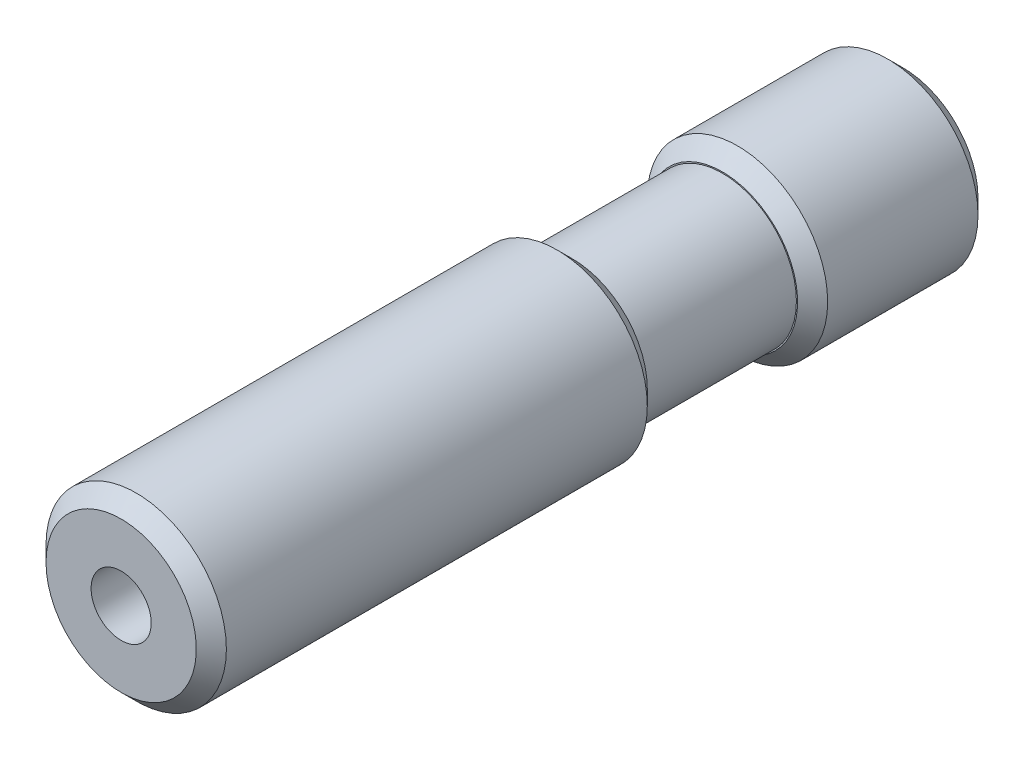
ISO-10303-21;
HEADER;
FILE_DESCRIPTION(('STEP AP214'),'2;1');
FILE_NAME('part.step','',(''),(''),'','','');
FILE_SCHEMA(('AUTOMOTIVE_DESIGN { 1 0 10303 214 1 1 1 1 }'));
ENDSEC;
DATA;
#1=APPLICATION_CONTEXT('core data for automotive mechanical design processes');
#2=APPLICATION_PROTOCOL_DEFINITION('international standard','automotive_design',2000,#1);
#3=PRODUCT_CONTEXT('',#1,'mechanical');
#4=PRODUCT('Part','Part','',(#3));
#5=PRODUCT_RELATED_PRODUCT_CATEGORY('part','',(#4));
#6=PRODUCT_DEFINITION_FORMATION('','',#4);
#7=PRODUCT_DEFINITION_CONTEXT('part definition',#1,'design');
#8=PRODUCT_DEFINITION('design','',#6,#7);
#9=PRODUCT_DEFINITION_SHAPE('','',#8);
#10=(LENGTH_UNIT() NAMED_UNIT(*) SI_UNIT(.MILLI.,.METRE.));
#11=(NAMED_UNIT(*) PLANE_ANGLE_UNIT() SI_UNIT($,.RADIAN.));
#12=(NAMED_UNIT(*) SI_UNIT($,.STERADIAN.) SOLID_ANGLE_UNIT());
#13=UNCERTAINTY_MEASURE_WITH_UNIT(LENGTH_MEASURE(1.E-05),#10,'distance_accuracy_value','');
#14=(GEOMETRIC_REPRESENTATION_CONTEXT(3) GLOBAL_UNCERTAINTY_ASSIGNED_CONTEXT((#13)) GLOBAL_UNIT_ASSIGNED_CONTEXT((#10,
#11,#12)) REPRESENTATION_CONTEXT('',''));
#15=CARTESIAN_POINT('',(0.,0.,0.));
#16=DIRECTION('',(0.,0.,1.));
#17=DIRECTION('',(1.,0.,0.));
#18=AXIS2_PLACEMENT_3D('',#15,#16,#17);
#19=CARTESIAN_POINT('',(0.,0.,0.));
#20=DIRECTION('',(0.,0.,1.));
#21=DIRECTION('',(1.,0.,0.));
#22=AXIS2_PLACEMENT_3D('',#19,#20,#21);
#23=CYLINDRICAL_SURFACE('',#22,3.00000000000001);
#24=CARTESIAN_POINT('',(0.,0.,-20.5000000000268));
#25=DIRECTION('',(0.,0.,-1.));
#26=DIRECTION('',(-1.,0.,0.));
#27=AXIS2_PLACEMENT_3D('',#24,#25,#26);
#28=CIRCLE('',#27,2.9999999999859);
#29=CARTESIAN_POINT('',(-2.9999999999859,0.,-20.5000000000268));
#30=VERTEX_POINT('',#29);
#31=EDGE_CURVE('E33',#30,#30,#28,.F.);
#32=ORIENTED_EDGE('',*,*,#31,.F.);
#33=EDGE_LOOP('',(#32));
#34=FACE_BOUND('',#33,.T.);
#35=CARTESIAN_POINT('',(0.,0.,-25.5000000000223));
#36=DIRECTION('',(0.,0.,1.));
#37=DIRECTION('',(1.,0.,0.));
#38=AXIS2_PLACEMENT_3D('',#35,#36,#37);
#39=CIRCLE('',#38,2.9999999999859);
#40=CARTESIAN_POINT('',(2.9999999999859,0.,-25.5000000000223));
#41=VERTEX_POINT('',#40);
#42=EDGE_CURVE('E30',#41,#41,#39,.F.);
#43=ORIENTED_EDGE('',*,*,#42,.F.);
#44=EDGE_LOOP('',(#43));
#45=FACE_BOUND('',#44,.T.);
#46=ADVANCED_FACE('F15',(#34,#45),#23,.T.);
#47=CARTESIAN_POINT('',(0.,0.,-20.49999999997));
#48=DIRECTION('',(0.,0.,-1.));
#49=DIRECTION('',(-1.,0.,0.));
#50=AXIS2_PLACEMENT_3D('',#47,#48,#49);
#51=CONICAL_SURFACE('',#50,2.99999999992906,0.785398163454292);
#52=CARTESIAN_POINT('',(0.,0.,-20.0000000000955));
#53=DIRECTION('',(0.,0.,-1.));
#54=DIRECTION('',(-1.,0.,0.));
#55=AXIS2_PLACEMENT_3D('',#52,#53,#54);
#56=CIRCLE('',#55,2.49999999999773);
#57=CARTESIAN_POINT('',(-2.49999999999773,0.,-20.0000000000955));
#58=VERTEX_POINT('',#57);
#59=EDGE_CURVE('E18',#58,#58,#56,.T.);
#60=ORIENTED_EDGE('',*,*,#59,.T.);
#61=EDGE_LOOP('',(#60));
#62=FACE_BOUND('',#61,.T.);
#63=ORIENTED_EDGE('',*,*,#31,.T.);
#64=EDGE_LOOP('',(#63));
#65=FACE_BOUND('',#64,.T.);
#66=ADVANCED_FACE('F59',(#62,#65),#51,.T.);
#67=CARTESIAN_POINT('',(0.,0.,-25.5000000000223));
#68=DIRECTION('',(0.,0.,1.));
#69=DIRECTION('',(1.,0.,0.));
#70=AXIS2_PLACEMENT_3D('',#67,#68,#69);
#71=CONICAL_SURFACE('',#70,2.9999999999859,0.785398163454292);
#72=ORIENTED_EDGE('',*,*,#42,.T.);
#73=EDGE_LOOP('',(#72));
#74=FACE_BOUND('',#73,.T.);
#75=CARTESIAN_POINT('',(0.,0.,-26.0000000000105));
#76=DIRECTION('',(0.,0.,1.));
#77=DIRECTION('',(1.,0.,0.));
#78=AXIS2_PLACEMENT_3D('',#75,#76,#77);
#79=CIRCLE('',#78,2.49999999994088);
#80=CARTESIAN_POINT('',(2.49999999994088,0.,-26.0000000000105));
#81=VERTEX_POINT('',#80);
#82=EDGE_CURVE('E52',#81,#81,#79,.T.);
#83=ORIENTED_EDGE('',*,*,#82,.T.);
#84=EDGE_LOOP('',(#83));
#85=FACE_BOUND('',#84,.T.);
#86=ADVANCED_FACE('F66',(#74,#85),#71,.T.);
#87=CARTESIAN_POINT('',(0.,2.50000000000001,-20.));
#88=DIRECTION('',(0.,0.,-1.));
#89=DIRECTION('',(-1.,0.,0.));
#90=AXIS2_PLACEMENT_3D('',#87,#88,#89);
#91=PLANE('',#90);
#92=ORIENTED_EDGE('',*,*,#59,.F.);
#93=EDGE_LOOP('',(#92));
#94=FACE_BOUND('',#93,.T.);
#95=CARTESIAN_POINT('',(0.,0.,-20.));
#96=DIRECTION('',(0.,0.,1.));
#97=DIRECTION('',(1.,0.,0.));
#98=AXIS2_PLACEMENT_3D('',#95,#96,#97);
#99=CIRCLE('',#98,2.45989001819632);
#100=CARTESIAN_POINT('',(2.45989001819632,0.,-20.));
#101=VERTEX_POINT('',#100);
#102=EDGE_CURVE('E50',#101,#101,#99,.T.);
#103=ORIENTED_EDGE('',*,*,#102,.F.);
#104=EDGE_LOOP('',(#103));
#105=FACE_BOUND('',#104,.T.);
#106=ADVANCED_FACE('F62',(#94,#105),#91,.F.);
#107=CARTESIAN_POINT('',(0.,1.,-26.));
#108=DIRECTION('',(0.,0.,1.));
#109=DIRECTION('',(1.,0.,0.));
#110=AXIS2_PLACEMENT_3D('',#107,#108,#109);
#111=PLANE('',#110);
#112=CARTESIAN_POINT('',(0.,0.,-26.));
#113=DIRECTION('',(0.,0.,1.));
#114=DIRECTION('',(1.,0.,0.));
#115=AXIS2_PLACEMENT_3D('',#112,#113,#114);
#116=CIRCLE('',#115,1.);
#117=CARTESIAN_POINT('',(1.,0.,-26.));
#118=VERTEX_POINT('',#117);
#119=EDGE_CURVE('E47',#118,#118,#116,.T.);
#120=ORIENTED_EDGE('',*,*,#119,.T.);
#121=EDGE_LOOP('',(#120));
#122=FACE_BOUND('',#121,.T.);
#123=ORIENTED_EDGE('',*,*,#82,.F.);
#124=EDGE_LOOP('',(#123));
#125=FACE_BOUND('',#124,.T.);
#126=ADVANCED_FACE('F65',(#122,#125),#111,.F.);
#127=CARTESIAN_POINT('',(0.,0.,0.));
#128=DIRECTION('',(0.,0.,1.));
#129=DIRECTION('',(1.,0.,0.));
#130=AXIS2_PLACEMENT_3D('',#127,#128,#129);
#131=CYLINDRICAL_SURFACE('',#130,2.45989001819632);
#132=CARTESIAN_POINT('',(0.,0.,-15.));
#133=DIRECTION('',(0.,0.,1.));
#134=DIRECTION('',(1.,0.,0.));
#135=AXIS2_PLACEMENT_3D('',#132,#133,#134);
#136=CIRCLE('',#135,2.45989001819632);
#137=CARTESIAN_POINT('',(2.45989001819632,0.,-15.));
#138=VERTEX_POINT('',#137);
#139=EDGE_CURVE('E44',#138,#138,#136,.F.);
#140=ORIENTED_EDGE('',*,*,#139,.T.);
#141=EDGE_LOOP('',(#140));
#142=FACE_BOUND('',#141,.T.);
#143=ORIENTED_EDGE('',*,*,#102,.T.);
#144=EDGE_LOOP('',(#143));
#145=FACE_BOUND('',#144,.T.);
#146=ADVANCED_FACE('F70',(#142,#145),#131,.T.);
#147=CARTESIAN_POINT('',(0.,0.,0.));
#148=DIRECTION('',(0.,0.,1.));
#149=DIRECTION('',(1.,0.,0.));
#150=AXIS2_PLACEMENT_3D('',#147,#148,#149);
#151=CYLINDRICAL_SURFACE('',#150,1.);
#152=ORIENTED_EDGE('',*,*,#119,.F.);
#153=EDGE_LOOP('',(#152));
#154=FACE_BOUND('',#153,.T.);
#155=CARTESIAN_POINT('',(0.,0.,0.));
#156=DIRECTION('',(0.,0.,1.));
#157=DIRECTION('',(1.,0.,0.));
#158=AXIS2_PLACEMENT_3D('',#155,#156,#157);
#159=CIRCLE('',#158,1.);
#160=CARTESIAN_POINT('',(1.,0.,0.));
#161=VERTEX_POINT('',#160);
#162=EDGE_CURVE('E41',#161,#161,#159,.T.);
#163=ORIENTED_EDGE('',*,*,#162,.T.);
#164=EDGE_LOOP('',(#163));
#165=FACE_BOUND('',#164,.T.);
#166=ADVANCED_FACE('F72',(#154,#165),#151,.F.);
#167=CARTESIAN_POINT('',(0.,2.45989001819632,-15.));
#168=DIRECTION('',(0.,0.,1.));
#169=DIRECTION('',(1.,0.,0.));
#170=AXIS2_PLACEMENT_3D('',#167,#168,#169);
#171=PLANE('',#170);
#172=ORIENTED_EDGE('',*,*,#139,.F.);
#173=EDGE_LOOP('',(#172));
#174=FACE_BOUND('',#173,.T.);
#175=CARTESIAN_POINT('',(0.,0.,-15.0000000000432));
#176=DIRECTION('',(0.,0.,1.));
#177=DIRECTION('',(1.,0.,0.));
#178=AXIS2_PLACEMENT_3D('',#175,#176,#177);
#179=CIRCLE('',#178,2.49999999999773);
#180=CARTESIAN_POINT('',(2.49999999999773,0.,-15.0000000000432));
#181=VERTEX_POINT('',#180);
#182=EDGE_CURVE('E38',#181,#181,#179,.T.);
#183=ORIENTED_EDGE('',*,*,#182,.F.);
#184=EDGE_LOOP('',(#183));
#185=FACE_BOUND('',#184,.T.);
#186=ADVANCED_FACE('F80',(#174,#185),#171,.F.);
#187=CARTESIAN_POINT('',(0.,2.5,0.));
#188=DIRECTION('',(0.,0.,-1.));
#189=DIRECTION('',(-1.,0.,0.));
#190=AXIS2_PLACEMENT_3D('',#187,#188,#189);
#191=PLANE('',#190);
#192=CARTESIAN_POINT('',(0.,0.,-5.6843418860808E-11));
#193=DIRECTION('',(0.,0.,-1.));
#194=DIRECTION('',(-1.,0.,0.));
#195=AXIS2_PLACEMENT_3D('',#192,#193,#194);
#196=CIRCLE('',#195,2.49999999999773);
#197=CARTESIAN_POINT('',(-2.49999999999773,0.,-5.6843418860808E-11));
#198=VERTEX_POINT('',#197);
#199=EDGE_CURVE('E27',#198,#198,#196,.T.);
#200=ORIENTED_EDGE('',*,*,#199,.F.);
#201=EDGE_LOOP('',(#200));
#202=FACE_BOUND('',#201,.T.);
#203=ORIENTED_EDGE('',*,*,#162,.F.);
#204=EDGE_LOOP('',(#203));
#205=FACE_BOUND('',#204,.T.);
#206=ADVANCED_FACE('F99',(#202,#205),#191,.F.);
#207=CARTESIAN_POINT('',(0.,0.,-14.500000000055));
#208=DIRECTION('',(0.,0.,1.));
#209=DIRECTION('',(1.,0.,0.));
#210=AXIS2_PLACEMENT_3D('',#207,#208,#209);
#211=CONICAL_SURFACE('',#210,2.9999999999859,0.785398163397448);
#212=CARTESIAN_POINT('',(0.,0.,-14.5));
#213=DIRECTION('',(0.,0.,1.));
#214=DIRECTION('',(1.,0.,0.));
#215=AXIS2_PLACEMENT_3D('',#212,#213,#214);
#216=CIRCLE('',#215,3.);
#217=CARTESIAN_POINT('',(3.,0.,-14.5));
#218=VERTEX_POINT('',#217);
#219=EDGE_CURVE('E22',#218,#218,#216,.T.);
#220=ORIENTED_EDGE('',*,*,#219,.F.);
#221=EDGE_LOOP('',(#220));
#222=FACE_BOUND('',#221,.T.);
#223=ORIENTED_EDGE('',*,*,#182,.T.);
#224=EDGE_LOOP('',(#223));
#225=FACE_BOUND('',#224,.T.);
#226=ADVANCED_FACE('F92',(#222,#225),#211,.T.);
#227=CARTESIAN_POINT('',(0.,0.,-0.499999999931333));
#228=DIRECTION('',(0.,0.,-1.));
#229=DIRECTION('',(-1.,0.,0.));
#230=AXIS2_PLACEMENT_3D('',#227,#228,#229);
#231=CONICAL_SURFACE('',#230,2.99999999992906,0.785398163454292);
#232=CARTESIAN_POINT('',(0.,0.,-0.5));
#233=DIRECTION('',(0.,0.,1.));
#234=DIRECTION('',(1.,0.,0.));
#235=AXIS2_PLACEMENT_3D('',#232,#233,#234);
#236=CIRCLE('',#235,3.);
#237=CARTESIAN_POINT('',(3.,0.,-0.5));
#238=VERTEX_POINT('',#237);
#239=EDGE_CURVE('E10',#238,#238,#236,.F.);
#240=ORIENTED_EDGE('',*,*,#239,.F.);
#241=EDGE_LOOP('',(#240));
#242=FACE_BOUND('',#241,.T.);
#243=ORIENTED_EDGE('',*,*,#199,.T.);
#244=EDGE_LOOP('',(#243));
#245=FACE_BOUND('',#244,.T.);
#246=ADVANCED_FACE('F87',(#242,#245),#231,.T.);
#247=CARTESIAN_POINT('',(0.,0.,0.));
#248=DIRECTION('',(0.,0.,1.));
#249=DIRECTION('',(1.,0.,0.));
#250=AXIS2_PLACEMENT_3D('',#247,#248,#249);
#251=CYLINDRICAL_SURFACE('',#250,3.);
#252=ORIENTED_EDGE('',*,*,#239,.T.);
#253=EDGE_LOOP('',(#252));
#254=FACE_BOUND('',#253,.T.);
#255=ORIENTED_EDGE('',*,*,#219,.T.);
#256=EDGE_LOOP('',(#255));
#257=FACE_BOUND('',#256,.T.);
#258=ADVANCED_FACE('F85',(#254,#257),#251,.T.);
#259=CLOSED_SHELL('',(#46,#66,#86,#106,#126,#146,#166,#186,#206,#226,#246,#258));
#260=MANIFOLD_SOLID_BREP('B1',#259);
#261=ADVANCED_BREP_SHAPE_REPRESENTATION('',(#18,#260),#14);
#262=SHAPE_DEFINITION_REPRESENTATION(#9,#261);
ENDSEC;
END-ISO-10303-21;
